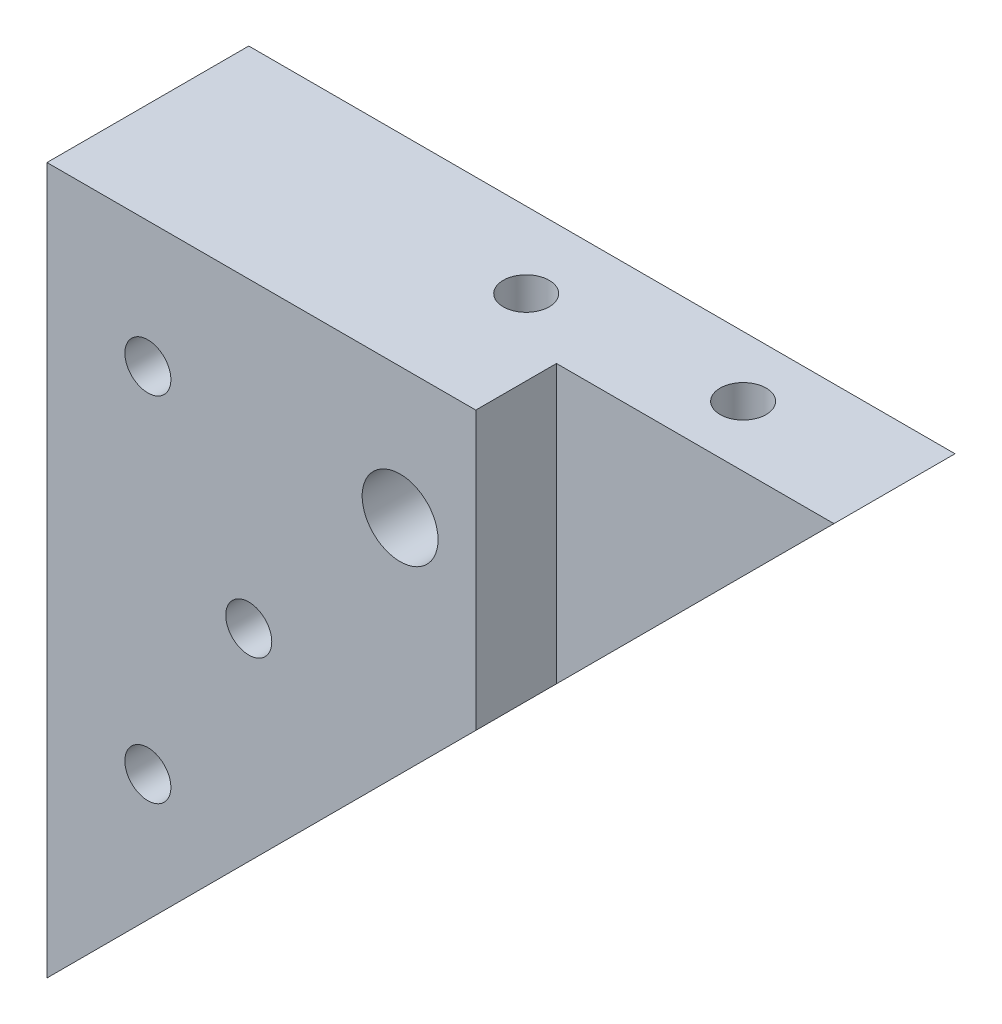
ISO-10303-21;
HEADER;
FILE_DESCRIPTION(('STEP AP214'),'2;1');
FILE_NAME('part.step','',(''),(''),'','','');
FILE_SCHEMA(('AUTOMOTIVE_DESIGN { 1 0 10303 214 1 1 1 1 }'));
ENDSEC;
DATA;
#1=APPLICATION_CONTEXT('core data for automotive mechanical design processes');
#2=APPLICATION_PROTOCOL_DEFINITION('international standard','automotive_design',2000,#1);
#3=PRODUCT_CONTEXT('',#1,'mechanical');
#4=PRODUCT('Part','Part','',(#3));
#5=PRODUCT_RELATED_PRODUCT_CATEGORY('part','',(#4));
#6=PRODUCT_DEFINITION_FORMATION('','',#4);
#7=PRODUCT_DEFINITION_CONTEXT('part definition',#1,'design');
#8=PRODUCT_DEFINITION('design','',#6,#7);
#9=PRODUCT_DEFINITION_SHAPE('','',#8);
#10=(LENGTH_UNIT() NAMED_UNIT(*) SI_UNIT(.MILLI.,.METRE.));
#11=(NAMED_UNIT(*) PLANE_ANGLE_UNIT() SI_UNIT($,.RADIAN.));
#12=(NAMED_UNIT(*) SI_UNIT($,.STERADIAN.) SOLID_ANGLE_UNIT());
#13=UNCERTAINTY_MEASURE_WITH_UNIT(LENGTH_MEASURE(1.E-05),#10,'distance_accuracy_value','');
#14=(GEOMETRIC_REPRESENTATION_CONTEXT(3) GLOBAL_UNCERTAINTY_ASSIGNED_CONTEXT((#13)) GLOBAL_UNIT_ASSIGNED_CONTEXT((#10,
#11,#12)) REPRESENTATION_CONTEXT('',''));
#15=CARTESIAN_POINT('',(0.,0.,0.));
#16=DIRECTION('',(0.,0.,1.));
#17=DIRECTION('',(1.,0.,0.));
#18=AXIS2_PLACEMENT_3D('',#15,#16,#17);
#19=CARTESIAN_POINT('',(88.9,88.9,-25.4));
#20=DIRECTION('',(0.,-1.,0.));
#21=DIRECTION('',(1.,0.,0.));
#22=AXIS2_PLACEMENT_3D('',#19,#20,#21);
#23=PLANE('',#22);
#24=CARTESIAN_POINT('',(44.45,88.9,-15.875));
#25=DIRECTION('',(0.,-1.,0.));
#26=DIRECTION('',(-1.,0.,0.));
#27=AXIS2_PLACEMENT_3D('',#24,#25,#26);
#28=CIRCLE('',#27,2.8956);
#29=CARTESIAN_POINT('',(41.5544,88.9,-15.875));
#30=VERTEX_POINT('',#29);
#31=EDGE_CURVE('E228',#30,#30,#28,.T.);
#32=ORIENTED_EDGE('',*,*,#31,.T.);
#33=EDGE_LOOP('',(#32));
#34=FACE_BOUND('',#33,.T.);
#35=CARTESIAN_POINT('',(69.85,88.9,-17.78));
#36=DIRECTION('',(0.,-1.,0.));
#37=DIRECTION('',(-1.,0.,0.));
#38=AXIS2_PLACEMENT_3D('',#35,#36,#37);
#39=CIRCLE('',#38,2.89559999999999);
#40=CARTESIAN_POINT('',(66.9544,88.9,-17.78));
#41=VERTEX_POINT('',#40);
#42=EDGE_CURVE('E107',#41,#41,#39,.T.);
#43=ORIENTED_EDGE('',*,*,#42,.T.);
#44=EDGE_LOOP('',(#43));
#45=FACE_BOUND('',#44,.T.);
#46=DIRECTION('',(0.,0.,1.));
#47=VECTOR('',#46,1.);
#48=CARTESIAN_POINT('',(88.9,88.9,-25.4));
#49=LINE('',#48,#47);
#50=CARTESIAN_POINT('',(88.9,88.9,-25.4));
#51=VERTEX_POINT('',#50);
#52=CARTESIAN_POINT('',(88.9,88.9,-10.16));
#53=VERTEX_POINT('',#52);
#54=EDGE_CURVE('E147',#51,#53,#49,.T.);
#55=ORIENTED_EDGE('',*,*,#54,.F.);
#56=DIRECTION('',(-1.,0.,0.));
#57=VECTOR('',#56,1.);
#58=CARTESIAN_POINT('',(88.9,88.9,-25.4));
#59=LINE('',#58,#57);
#60=CARTESIAN_POINT('',(0.,88.9,-25.4));
#61=VERTEX_POINT('',#60);
#62=EDGE_CURVE('E139',#51,#61,#59,.T.);
#63=ORIENTED_EDGE('',*,*,#62,.T.);
#64=DIRECTION('',(0.,0.,1.));
#65=VECTOR('',#64,1.);
#66=CARTESIAN_POINT('',(0.,88.9,-25.4));
#67=LINE('',#66,#65);
#68=CARTESIAN_POINT('',(0.,88.9,0.));
#69=VERTEX_POINT('',#68);
#70=EDGE_CURVE('E153',#61,#69,#67,.T.);
#71=ORIENTED_EDGE('',*,*,#70,.T.);
#72=DIRECTION('',(-1.,0.,0.));
#73=VECTOR('',#72,1.);
#74=CARTESIAN_POINT('',(88.9,88.9,0.));
#75=LINE('',#74,#73);
#76=CARTESIAN_POINT('',(53.975,88.9,0.));
#77=VERTEX_POINT('',#76);
#78=EDGE_CURVE('E131',#77,#69,#75,.T.);
#79=ORIENTED_EDGE('',*,*,#78,.F.);
#80=DIRECTION('',(0.,0.,-1.));
#81=VECTOR('',#80,1.);
#82=CARTESIAN_POINT('',(53.975,88.9,-10.16));
#83=LINE('',#82,#81);
#84=CARTESIAN_POINT('',(53.975,88.9,-10.16));
#85=VERTEX_POINT('',#84);
#86=EDGE_CURVE('E121',#77,#85,#83,.T.);
#87=ORIENTED_EDGE('',*,*,#86,.T.);
#88=DIRECTION('',(1.,0.,0.));
#89=VECTOR('',#88,1.);
#90=CARTESIAN_POINT('',(88.9,88.9,-10.16));
#91=LINE('',#90,#89);
#92=EDGE_CURVE('E124',#85,#53,#91,.T.);
#93=ORIENTED_EDGE('',*,*,#92,.T.);
#94=EDGE_LOOP('',(#55,#63,#71,#79,#87,#93));
#95=FACE_BOUND('',#94,.T.);
#96=ADVANCED_FACE('F34',(#34,#45,#95),#23,.F.);
#97=CARTESIAN_POINT('',(0.,88.9,-25.4));
#98=DIRECTION('',(1.,0.,0.));
#99=DIRECTION('',(0.,1.,0.));
#100=AXIS2_PLACEMENT_3D('',#97,#98,#99);
#101=PLANE('',#100);
#102=DIRECTION('',(0.,-1.,0.));
#103=VECTOR('',#102,1.);
#104=CARTESIAN_POINT('',(0.,88.9,0.));
#105=LINE('',#104,#103);
#106=CARTESIAN_POINT('',(0.,0.,0.));
#107=VERTEX_POINT('',#106);
#108=EDGE_CURVE('E134',#69,#107,#105,.T.);
#109=ORIENTED_EDGE('',*,*,#108,.F.);
#110=ORIENTED_EDGE('',*,*,#70,.F.);
#111=DIRECTION('',(0.,-1.,0.));
#112=VECTOR('',#111,1.);
#113=CARTESIAN_POINT('',(0.,88.9,-25.4));
#114=LINE('',#113,#112);
#115=CARTESIAN_POINT('',(0.,0.,-25.4));
#116=VERTEX_POINT('',#115);
#117=EDGE_CURVE('E142',#61,#116,#114,.T.);
#118=ORIENTED_EDGE('',*,*,#117,.T.);
#119=DIRECTION('',(0.,0.,1.));
#120=VECTOR('',#119,1.);
#121=CARTESIAN_POINT('',(0.,0.,-25.4));
#122=LINE('',#121,#120);
#123=EDGE_CURVE('E150',#116,#107,#122,.T.);
#124=ORIENTED_EDGE('',*,*,#123,.T.);
#125=EDGE_LOOP('',(#109,#110,#118,#124));
#126=FACE_BOUND('',#125,.T.);
#127=ADVANCED_FACE('F205',(#126),#101,.F.);
#128=CARTESIAN_POINT('',(0.,0.,-25.4));
#129=DIRECTION('',(-0.707106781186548,0.707106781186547,0.));
#130=DIRECTION('',(-0.707106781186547,-0.707106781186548,0.));
#131=AXIS2_PLACEMENT_3D('',#128,#129,#130);
#132=PLANE('',#131);
#133=DIRECTION('',(0.,0.,1.));
#134=VECTOR('',#133,1.);
#135=CARTESIAN_POINT('',(76.2,76.2,-25.4));
#136=LINE('',#135,#134);
#137=CARTESIAN_POINT('',(76.2,76.2,-19.684322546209));
#138=VERTEX_POINT('',#137);
#139=CARTESIAN_POINT('',(76.2,76.2,-15.875677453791));
#140=VERTEX_POINT('',#139);
#141=EDGE_CURVE('E95',#138,#140,#136,.T.);
#142=ORIENTED_EDGE('',*,*,#141,.F.);
#143=CARTESIAN_POINT('',(69.85,69.85,-17.78));
#144=DIRECTION('',(0.707106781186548,-0.707106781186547,0.));
#145=DIRECTION('',(0.707106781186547,0.707106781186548,0.));
#146=AXIS2_PLACEMENT_3D('',#143,#144,#145);
#147=ELLIPSE('',#146,9.3753873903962,6.6294);
#148=EDGE_CURVE('E99',#140,#138,#147,.T.);
#149=ORIENTED_EDGE('',*,*,#148,.F.);
#150=EDGE_LOOP('',(#142,#149));
#151=FACE_BOUND('',#150,.T.);
#152=DIRECTION('',(0.,0.,-1.));
#153=VECTOR('',#152,1.);
#154=CARTESIAN_POINT('',(53.975,53.975,-25.4));
#155=LINE('',#154,#153);
#156=CARTESIAN_POINT('',(53.975,53.975,0.));
#157=VERTEX_POINT('',#156);
#158=CARTESIAN_POINT('',(53.975,53.975,-10.16));
#159=VERTEX_POINT('',#158);
#160=EDGE_CURVE('E129',#157,#159,#155,.T.);
#161=ORIENTED_EDGE('',*,*,#160,.F.);
#162=DIRECTION('',(0.707106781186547,0.707106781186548,0.));
#163=VECTOR('',#162,1.);
#164=CARTESIAN_POINT('',(0.,0.,0.));
#165=LINE('',#164,#163);
#166=EDGE_CURVE('E137',#107,#157,#165,.T.);
#167=ORIENTED_EDGE('',*,*,#166,.F.);
#168=ORIENTED_EDGE('',*,*,#123,.F.);
#169=DIRECTION('',(0.707106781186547,0.707106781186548,0.));
#170=VECTOR('',#169,1.);
#171=CARTESIAN_POINT('',(0.,0.,-25.4));
#172=LINE('',#171,#170);
#173=EDGE_CURVE('E145',#116,#51,#172,.T.);
#174=ORIENTED_EDGE('',*,*,#173,.T.);
#175=ORIENTED_EDGE('',*,*,#54,.T.);
#176=DIRECTION('',(0.707106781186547,0.707106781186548,0.));
#177=VECTOR('',#176,1.);
#178=CARTESIAN_POINT('',(0.,0.,-10.16));
#179=LINE('',#178,#177);
#180=EDGE_CURVE('E103',#159,#53,#179,.T.);
#181=ORIENTED_EDGE('',*,*,#180,.F.);
#182=EDGE_LOOP('',(#161,#167,#168,#174,#175,#181));
#183=FACE_BOUND('',#182,.T.);
#184=ADVANCED_FACE('F105',(#151,#183),#132,.F.);
#185=CARTESIAN_POINT('',(0.,88.9,-25.4));
#186=DIRECTION('',(0.,0.,-1.));
#187=DIRECTION('',(1.,0.,0.));
#188=AXIS2_PLACEMENT_3D('',#185,#186,#187);
#189=PLANE('',#188);
#190=CARTESIAN_POINT('',(25.4,50.8,-25.4));
#191=DIRECTION('',(0.,0.,1.));
#192=DIRECTION('',(1.,0.,0.));
#193=AXIS2_PLACEMENT_3D('',#190,#191,#192);
#194=CIRCLE('',#193,4.92759999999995);
#195=CARTESIAN_POINT('',(30.3275999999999,50.8,-25.4));
#196=VERTEX_POINT('',#195);
#197=EDGE_CURVE('E166',#196,#196,#194,.F.);
#198=ORIENTED_EDGE('',*,*,#197,.F.);
#199=EDGE_LOOP('',(#198));
#200=FACE_BOUND('',#199,.T.);
#201=CARTESIAN_POINT('',(12.7,28.575,-25.4));
#202=DIRECTION('',(0.,0.,1.));
#203=DIRECTION('',(1.,0.,0.));
#204=AXIS2_PLACEMENT_3D('',#201,#202,#203);
#205=CIRCLE('',#204,4.92759999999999);
#206=CARTESIAN_POINT('',(17.6276,28.575,-25.4));
#207=VERTEX_POINT('',#206);
#208=EDGE_CURVE('E163',#207,#207,#205,.F.);
#209=ORIENTED_EDGE('',*,*,#208,.F.);
#210=EDGE_LOOP('',(#209));
#211=FACE_BOUND('',#210,.T.);
#212=CARTESIAN_POINT('',(12.7,73.025,-25.4));
#213=DIRECTION('',(0.,0.,1.));
#214=DIRECTION('',(1.,0.,0.));
#215=AXIS2_PLACEMENT_3D('',#212,#213,#214);
#216=CIRCLE('',#215,4.92759999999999);
#217=CARTESIAN_POINT('',(17.6276,73.025,-25.4));
#218=VERTEX_POINT('',#217);
#219=EDGE_CURVE('E160',#218,#218,#216,.F.);
#220=ORIENTED_EDGE('',*,*,#219,.F.);
#221=EDGE_LOOP('',(#220));
#222=FACE_BOUND('',#221,.T.);
#223=CARTESIAN_POINT('',(44.45,72.39,-25.4));
#224=DIRECTION('',(0.,0.,1.));
#225=DIRECTION('',(1.,0.,0.));
#226=AXIS2_PLACEMENT_3D('',#223,#224,#225);
#227=CIRCLE('',#226,4.77519999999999);
#228=CARTESIAN_POINT('',(49.2252,72.39,-25.4));
#229=VERTEX_POINT('',#228);
#230=EDGE_CURVE('E110',#229,#229,#227,.T.);
#231=ORIENTED_EDGE('',*,*,#230,.T.);
#232=EDGE_LOOP('',(#231));
#233=FACE_BOUND('',#232,.T.);
#234=ORIENTED_EDGE('',*,*,#62,.F.);
#235=ORIENTED_EDGE('',*,*,#173,.F.);
#236=ORIENTED_EDGE('',*,*,#117,.F.);
#237=EDGE_LOOP('',(#234,#235,#236));
#238=FACE_BOUND('',#237,.T.);
#239=ADVANCED_FACE('F199',(#200,#211,#222,#233,#238),#189,.T.);
#240=CARTESIAN_POINT('',(0.,88.9,0.));
#241=DIRECTION('',(0.,0.,-1.));
#242=DIRECTION('',(1.,0.,0.));
#243=AXIS2_PLACEMENT_3D('',#240,#241,#242);
#244=PLANE('',#243);
#245=CARTESIAN_POINT('',(25.4,50.8,0.));
#246=DIRECTION('',(0.,0.,1.));
#247=DIRECTION('',(1.,0.,0.));
#248=AXIS2_PLACEMENT_3D('',#245,#246,#247);
#249=CIRCLE('',#248,2.8956);
#250=CARTESIAN_POINT('',(28.2956,50.8,0.));
#251=VERTEX_POINT('',#250);
#252=EDGE_CURVE('E279',#251,#251,#249,.T.);
#253=ORIENTED_EDGE('',*,*,#252,.F.);
#254=EDGE_LOOP('',(#253));
#255=FACE_BOUND('',#254,.T.);
#256=CARTESIAN_POINT('',(12.7,28.575,0.));
#257=DIRECTION('',(0.,0.,1.));
#258=DIRECTION('',(1.,0.,0.));
#259=AXIS2_PLACEMENT_3D('',#256,#257,#258);
#260=CIRCLE('',#259,2.8956);
#261=CARTESIAN_POINT('',(15.5956,28.575,0.));
#262=VERTEX_POINT('',#261);
#263=EDGE_CURVE('E277',#262,#262,#260,.T.);
#264=ORIENTED_EDGE('',*,*,#263,.F.);
#265=EDGE_LOOP('',(#264));
#266=FACE_BOUND('',#265,.T.);
#267=CARTESIAN_POINT('',(12.7,73.025,0.));
#268=DIRECTION('',(0.,0.,1.));
#269=DIRECTION('',(1.,0.,0.));
#270=AXIS2_PLACEMENT_3D('',#267,#268,#269);
#271=CIRCLE('',#270,2.8956);
#272=CARTESIAN_POINT('',(15.5956,73.025,0.));
#273=VERTEX_POINT('',#272);
#274=EDGE_CURVE('E97',#273,#273,#271,.T.);
#275=ORIENTED_EDGE('',*,*,#274,.F.);
#276=EDGE_LOOP('',(#275));
#277=FACE_BOUND('',#276,.T.);
#278=CARTESIAN_POINT('',(44.45,72.39,0.));
#279=DIRECTION('',(0.,0.,1.));
#280=DIRECTION('',(1.,0.,0.));
#281=AXIS2_PLACEMENT_3D('',#278,#279,#280);
#282=CIRCLE('',#281,4.77519999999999);
#283=CARTESIAN_POINT('',(49.2252,72.39,0.));
#284=VERTEX_POINT('',#283);
#285=EDGE_CURVE('E118',#284,#284,#282,.T.);
#286=ORIENTED_EDGE('',*,*,#285,.F.);
#287=EDGE_LOOP('',(#286));
#288=FACE_BOUND('',#287,.T.);
#289=ORIENTED_EDGE('',*,*,#78,.T.);
#290=ORIENTED_EDGE('',*,*,#108,.T.);
#291=ORIENTED_EDGE('',*,*,#166,.T.);
#292=DIRECTION('',(0.,-1.,0.));
#293=VECTOR('',#292,1.);
#294=CARTESIAN_POINT('',(53.975,88.9,0.));
#295=LINE('',#294,#293);
#296=EDGE_CURVE('E62',#77,#157,#295,.T.);
#297=ORIENTED_EDGE('',*,*,#296,.F.);
#298=EDGE_LOOP('',(#289,#290,#291,#297));
#299=FACE_BOUND('',#298,.T.);
#300=ADVANCED_FACE('F193',(#255,#266,#277,#288,#299),#244,.F.);
#301=CARTESIAN_POINT('',(88.9,0.,-10.16));
#302=DIRECTION('',(0.,0.,-1.));
#303=DIRECTION('',(1.,0.,0.));
#304=AXIS2_PLACEMENT_3D('',#301,#302,#303);
#305=PLANE('',#304);
#306=DIRECTION('',(0.,1.,0.));
#307=VECTOR('',#306,1.);
#308=CARTESIAN_POINT('',(53.975,0.,-10.16));
#309=LINE('',#308,#307);
#310=EDGE_CURVE('E127',#159,#85,#309,.T.);
#311=ORIENTED_EDGE('',*,*,#310,.F.);
#312=ORIENTED_EDGE('',*,*,#180,.T.);
#313=ORIENTED_EDGE('',*,*,#92,.F.);
#314=EDGE_LOOP('',(#311,#312,#313));
#315=FACE_BOUND('',#314,.T.);
#316=ADVANCED_FACE('F189',(#315),#305,.F.);
#317=CARTESIAN_POINT('',(53.975,0.,-10.16));
#318=DIRECTION('',(-1.,0.,0.));
#319=DIRECTION('',(0.,-1.,0.));
#320=AXIS2_PLACEMENT_3D('',#317,#318,#319);
#321=PLANE('',#320);
#322=ORIENTED_EDGE('',*,*,#296,.T.);
#323=ORIENTED_EDGE('',*,*,#160,.T.);
#324=ORIENTED_EDGE('',*,*,#310,.T.);
#325=ORIENTED_EDGE('',*,*,#86,.F.);
#326=EDGE_LOOP('',(#322,#323,#324,#325));
#327=FACE_BOUND('',#326,.T.);
#328=ADVANCED_FACE('F186',(#327),#321,.F.);
#329=CARTESIAN_POINT('',(44.45,72.39,0.));
#330=DIRECTION('',(0.,0.,-1.));
#331=DIRECTION('',(1.,0.,0.));
#332=AXIS2_PLACEMENT_3D('',#329,#330,#331);
#333=CYLINDRICAL_SURFACE('',#332,4.77519999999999);
#334=CARTESIAN_POINT('',(41.5544,68.5928911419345,-15.875));
#335=CARTESIAN_POINT('',(41.5544007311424,68.5928900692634,-15.802458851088));
#336=CARTESIAN_POINT('',(41.557133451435,68.590801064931,-15.7298907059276));
#337=CARTESIAN_POINT('',(41.5680067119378,68.5825482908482,-15.5853779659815));
#338=CARTESIAN_POINT('',(41.5761510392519,68.5763816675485,-15.5134338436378));
#339=CARTESIAN_POINT('',(41.6085719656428,68.5520837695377,-15.299129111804));
#340=CARTESIAN_POINT('',(41.6408359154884,68.5281557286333,-15.158535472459));
#341=CARTESIAN_POINT('',(41.724391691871,68.4687577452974,-14.8872661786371));
#342=CARTESIAN_POINT('',(41.7755269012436,68.43338309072,-14.7565192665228));
#343=CARTESIAN_POINT('',(41.8949072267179,68.3552602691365,-14.5055823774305));
#344=CARTESIAN_POINT('',(41.9631508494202,68.3125127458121,-14.3853914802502));
#345=CARTESIAN_POINT('',(42.1248021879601,68.2179745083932,-14.1424201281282));
#346=CARTESIAN_POINT('',(42.220292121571,68.1657219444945,-14.0212042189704));
#347=CARTESIAN_POINT('',(42.429430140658,68.0617767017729,-13.7952049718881));
#348=CARTESIAN_POINT('',(42.5430933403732,68.0100845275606,-13.6904354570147));
#349=CARTESIAN_POINT('',(42.8008112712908,67.9062526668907,-13.4887373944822));
#350=CARTESIAN_POINT('',(42.9468394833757,67.8547012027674,-13.3939728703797));
#351=CARTESIAN_POINT('',(43.1788362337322,67.7863896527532,-13.2718655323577));
#352=CARTESIAN_POINT('',(43.2583531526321,67.7651167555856,-13.2344948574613));
#353=CARTESIAN_POINT('',(43.4211982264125,67.7261939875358,-13.1668973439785));
#354=CARTESIAN_POINT('',(43.5045237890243,67.7085416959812,-13.1366657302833));
#355=CARTESIAN_POINT('',(43.6661093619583,67.6789347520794,-13.0863675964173));
#356=CARTESIAN_POINT('',(43.7440818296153,67.6665945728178,-13.0656015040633));
#357=CARTESIAN_POINT('',(43.901935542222,67.6456882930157,-13.0305922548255));
#358=CARTESIAN_POINT('',(43.9818156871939,67.6371200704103,-13.0163454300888));
#359=CARTESIAN_POINT('',(44.1427787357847,67.62400991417,-12.9946003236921));
#360=CARTESIAN_POINT('',(44.2238609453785,67.6194657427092,-12.9870982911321));
#361=CARTESIAN_POINT('',(44.3864672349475,67.6145282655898,-12.9789508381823));
#362=CARTESIAN_POINT('',(44.4679912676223,67.6141345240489,-12.9783046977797));
#363=CARTESIAN_POINT('',(44.6914267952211,67.6188007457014,-12.9859948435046));
#364=CARTESIAN_POINT('',(44.8330887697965,67.6281412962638,-13.0013800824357));
#365=CARTESIAN_POINT('',(45.111281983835,67.6587333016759,-13.0523678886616));
#366=CARTESIAN_POINT('',(45.2478128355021,67.6799856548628,-13.0879719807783));
#367=CARTESIAN_POINT('',(45.5131783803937,67.7326853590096,-13.1779866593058));
#368=CARTESIAN_POINT('',(45.6419709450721,67.7641834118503,-13.2324908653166));
#369=CARTESIAN_POINT('',(45.8887193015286,67.8348793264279,-13.358297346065));
#370=CARTESIAN_POINT('',(46.0066723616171,67.8740791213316,-13.4296038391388));
#371=CARTESIAN_POINT('',(46.2436771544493,67.9624593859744,-13.5966868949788));
#372=CARTESIAN_POINT('',(46.3611409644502,68.0122734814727,-13.6943787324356));
#373=CARTESIAN_POINT('',(46.5790194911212,68.1139849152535,-13.9065128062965));
#374=CARTESIAN_POINT('',(46.6794102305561,68.165885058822,-14.0209781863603));
#375=CARTESIAN_POINT('',(46.8724473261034,68.2732210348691,-14.2795938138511));
#376=CARTESIAN_POINT('',(46.9627310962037,68.3283372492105,-14.4256570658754));
#377=CARTESIAN_POINT('',(47.1170140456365,68.4279242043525,-14.7343162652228));
#378=CARTESIAN_POINT('',(47.1810618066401,68.472414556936,-14.8968809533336));
#379=CARTESIAN_POINT('',(47.2669899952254,68.5339450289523,-15.1920731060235));
#380=CARTESIAN_POINT('',(47.2954262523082,68.5550757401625,-15.3219372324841));
#381=CARTESIAN_POINT('',(47.3341875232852,68.584134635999,-15.5857305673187));
#382=CARTESIAN_POINT('',(47.3445345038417,68.5920788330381,-15.7196546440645));
#383=CARTESIAN_POINT('',(47.3465102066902,68.593585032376,-15.9879347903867));
#384=CARTESIAN_POINT('',(47.3381090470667,68.5871240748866,-16.1222912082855));
#385=CARTESIAN_POINT('',(47.3030620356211,68.5607664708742,-16.387282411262));
#386=CARTESIAN_POINT('',(47.2764015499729,68.5408590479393,-16.5179141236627));
#387=CARTESIAN_POINT('',(47.2064016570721,68.4904346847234,-16.7716656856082));
#388=CARTESIAN_POINT('',(47.1631436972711,68.4599696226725,-16.894818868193));
#389=CARTESIAN_POINT('',(47.0615020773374,68.3917085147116,-17.1324920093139));
#390=CARTESIAN_POINT('',(47.0031128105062,68.3539097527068,-17.2470087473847));
#391=CARTESIAN_POINT('',(46.8605392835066,68.2668937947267,-17.486395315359));
#392=CARTESIAN_POINT('',(46.7735895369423,68.2168530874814,-17.6093218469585));
#393=CARTESIAN_POINT('',(46.5819782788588,68.1157771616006,-17.8401258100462));
#394=CARTESIAN_POINT('',(46.4772993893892,68.0647410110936,-17.9479882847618));
#395=CARTESIAN_POINT('',(46.2359184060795,67.9591310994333,-18.1606555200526));
#396=CARTESIAN_POINT('',(46.0967924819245,67.9050349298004,-18.263003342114));
#397=CARTESIAN_POINT('',(45.8743422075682,67.8314990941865,-18.3975552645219));
#398=CARTESIAN_POINT('',(45.797864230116,67.8082472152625,-18.4392575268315));
#399=CARTESIAN_POINT('',(45.6407427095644,67.7649284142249,-18.515881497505));
#400=CARTESIAN_POINT('',(45.5601018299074,67.7448594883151,-18.550807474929));
#401=CARTESIAN_POINT('',(45.4009442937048,67.7097846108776,-18.6112275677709));
#402=CARTESIAN_POINT('',(45.32266797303,67.6945241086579,-18.637207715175));
#403=CARTESIAN_POINT('',(45.1636269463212,67.667736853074,-18.6825019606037));
#404=CARTESIAN_POINT('',(45.0828636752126,67.6562079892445,-18.7018198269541));
#405=CARTESIAN_POINT('',(44.919561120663,67.6372331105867,-18.7334820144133));
#406=CARTESIAN_POINT('',(44.8370231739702,67.6297841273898,-18.7458314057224));
#407=CARTESIAN_POINT('',(44.6709469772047,67.6191869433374,-18.7633672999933));
#408=CARTESIAN_POINT('',(44.587408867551,67.6160381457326,-18.7685547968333));
#409=CARTESIAN_POINT('',(44.359490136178,67.6134891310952,-18.7727674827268));
#410=CARTESIAN_POINT('',(44.2148397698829,67.6184522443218,-18.764613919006));
#411=CARTESIAN_POINT('',(43.9294541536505,67.6410935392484,-18.7270675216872));
#412=CARTESIAN_POINT('',(43.7887188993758,67.6587717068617,-18.6976747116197));
#413=CARTESIAN_POINT('',(43.5176656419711,67.7047248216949,-18.619945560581));
#414=CARTESIAN_POINT('',(43.3871932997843,67.7327752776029,-18.572009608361));
#415=CARTESIAN_POINT('',(43.136161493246,67.797268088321,-18.4590466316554));
#416=CARTESIAN_POINT('',(43.0156040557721,67.8337121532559,-18.3940161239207));
#417=CARTESIAN_POINT('',(42.7738013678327,67.9166416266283,-18.2409008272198));
#418=CARTESIAN_POINT('',(42.6538792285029,67.9637856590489,-18.151087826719));
#419=CARTESIAN_POINT('',(42.4298840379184,68.0614169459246,-17.9548661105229));
#420=CARTESIAN_POINT('',(42.3258296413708,68.1119080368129,-17.8484381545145));
#421=CARTESIAN_POINT('',(42.1224353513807,68.2186901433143,-17.6056730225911));
#422=CARTESIAN_POINT('',(42.0255193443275,68.2748696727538,-17.4672428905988));
#423=CARTESIAN_POINT('',(41.8562598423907,68.3793934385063,-17.1733379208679));
#424=CARTESIAN_POINT('',(41.7838972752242,68.4277437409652,-17.0178764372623));
#425=CARTESIAN_POINT('',(41.6800519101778,68.4998849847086,-16.7293278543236));
#426=CARTESIAN_POINT('',(41.643049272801,68.5267490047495,-16.5989940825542));
#427=CARTESIAN_POINT('',(41.5875946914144,68.5676448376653,-16.332699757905));
#428=CARTESIAN_POINT('',(41.5690810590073,68.5817193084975,-16.1967595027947));
#429=CARTESIAN_POINT('',(41.5583462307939,68.5898854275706,-16.0292685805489));
#430=CARTESIAN_POINT('',(41.5568678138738,68.5910105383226,-15.9984503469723));
#431=CARTESIAN_POINT('',(41.554894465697,68.5925136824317,-15.9367563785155));
#432=CARTESIAN_POINT('',(41.554399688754,68.5928915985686,-15.9058806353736));
#433=CARTESIAN_POINT('',(41.5544,68.5928911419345,-15.875));
#434=B_SPLINE_CURVE_WITH_KNOTS('',3,(#334,#335,#336,#337,#338,#339,#340,#341,#342,#343,#344,
#345,#346,#347,#348,#349,#350,#351,#352,#353,#354,#355,#356,#357,#358,#359,#360,#361,#362,#363,
#364,#365,#366,#367,#368,#369,#370,#371,#372,#373,#374,#375,#376,#377,#378,#379,#380,#381,#382,
#383,#384,#385,#386,#387,#388,#389,#390,#391,#392,#393,#394,#395,#396,#397,#398,#399,#400,#401,
#402,#403,#404,#405,#406,#407,#408,#409,#410,#411,#412,#413,#414,#415,#416,#417,#418,#419,#420,
#421,#422,#423,#424,#425,#426,#427,#428,#429,#430,#431,#432,#433),.UNSPECIFIED.,.T.,.F.,(4,2,2,
2,2,2,2,2,2,2,2,2,2,2,2,2,2,2,2,2,2,2,2,2,2,2,2,2,2,2,2,2,2,2,2,2,2,2,2,2,2,2,2,2,2,2,2,2,2,4),
(0.,0.217582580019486,0.435317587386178,0.871494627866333,1.30413027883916,1.73672817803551,
2.22356215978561,2.71080315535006,3.25217192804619,3.52301758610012,3.79368156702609,
4.03821615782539,4.28261299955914,4.5268738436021,4.77110903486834,5.19726066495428,
5.62344443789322,6.05177015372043,6.48020351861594,6.96038218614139,7.44122974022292,
7.97959199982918,8.51695280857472,8.91906410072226,9.32068675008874,9.72294998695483,
10.1255359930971,10.5261711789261,10.9269550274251,11.4011186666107,11.8757497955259,
12.4156024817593,12.6857513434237,12.9557294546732,13.2069901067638,13.4581084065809,
13.7090437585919,13.9599442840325,14.3924615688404,14.8249783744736,15.2486351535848,
15.6723783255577,16.1417386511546,16.6116465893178,17.1434146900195,17.6747687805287,
18.0874967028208,18.4988429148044,18.5914528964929,18.6840774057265),.UNSPECIFIED.);
#435=CARTESIAN_POINT('',(41.5544,68.5928911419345,-15.875));
#436=VERTEX_POINT('',#435);
#437=EDGE_CURVE('E37',#436,#436,#434,.T.);
#438=ORIENTED_EDGE('',*,*,#437,.F.);
#439=EDGE_LOOP('',(#438));
#440=FACE_BOUND('',#439,.T.);
#441=CARTESIAN_POINT('',(41.5544,76.1871088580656,-15.875));
#442=CARTESIAN_POINT('',(41.5544007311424,76.1871099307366,-15.947541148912));
#443=CARTESIAN_POINT('',(41.557133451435,76.189198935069,-16.0201092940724));
#444=CARTESIAN_POINT('',(41.5680067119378,76.1974517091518,-16.1646220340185));
#445=CARTESIAN_POINT('',(41.5761510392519,76.2036183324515,-16.2365661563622));
#446=CARTESIAN_POINT('',(41.6085719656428,76.2279162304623,-16.450870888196));
#447=CARTESIAN_POINT('',(41.6408359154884,76.2518442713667,-16.591464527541));
#448=CARTESIAN_POINT('',(41.724391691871,76.3112422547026,-16.8627338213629));
#449=CARTESIAN_POINT('',(41.7755269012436,76.34661690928,-16.9934807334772));
#450=CARTESIAN_POINT('',(41.8949072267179,76.4247397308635,-17.2444176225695));
#451=CARTESIAN_POINT('',(41.9631508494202,76.4674872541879,-17.3646085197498));
#452=CARTESIAN_POINT('',(42.1248021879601,76.5620254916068,-17.6075798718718));
#453=CARTESIAN_POINT('',(42.220292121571,76.6142780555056,-17.7287957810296));
#454=CARTESIAN_POINT('',(42.429430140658,76.7182232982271,-17.9547950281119));
#455=CARTESIAN_POINT('',(42.5430933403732,76.7699154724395,-18.0595645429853));
#456=CARTESIAN_POINT('',(42.8008112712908,76.8737473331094,-18.2612626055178));
#457=CARTESIAN_POINT('',(42.9468394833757,76.9252987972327,-18.3560271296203));
#458=CARTESIAN_POINT('',(43.1788362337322,76.9936103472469,-18.4781344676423));
#459=CARTESIAN_POINT('',(43.2583531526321,77.0148832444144,-18.5155051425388));
#460=CARTESIAN_POINT('',(43.4211982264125,77.0538060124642,-18.5831026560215));
#461=CARTESIAN_POINT('',(43.5045237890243,77.0714583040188,-18.6133342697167));
#462=CARTESIAN_POINT('',(43.6661093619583,77.1010652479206,-18.6636324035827));
#463=CARTESIAN_POINT('',(43.7440818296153,77.1134054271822,-18.6843984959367));
#464=CARTESIAN_POINT('',(43.901935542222,77.1343117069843,-18.7194077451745));
#465=CARTESIAN_POINT('',(43.9818156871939,77.1428799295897,-18.7336545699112));
#466=CARTESIAN_POINT('',(44.1427787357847,77.15599008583,-18.7553996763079));
#467=CARTESIAN_POINT('',(44.2238609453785,77.1605342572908,-18.7629017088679));
#468=CARTESIAN_POINT('',(44.3864672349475,77.1654717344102,-18.7710491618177));
#469=CARTESIAN_POINT('',(44.4679912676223,77.1658654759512,-18.7716953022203));
#470=CARTESIAN_POINT('',(44.6914267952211,77.1611992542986,-18.7640051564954));
#471=CARTESIAN_POINT('',(44.8330887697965,77.1518587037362,-18.7486199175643));
#472=CARTESIAN_POINT('',(45.111281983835,77.1212666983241,-18.6976321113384));
#473=CARTESIAN_POINT('',(45.2478128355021,77.1000143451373,-18.6620280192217));
#474=CARTESIAN_POINT('',(45.5131783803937,77.0473146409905,-18.5720133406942));
#475=CARTESIAN_POINT('',(45.6419709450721,77.0158165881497,-18.5175091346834));
#476=CARTESIAN_POINT('',(45.8887193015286,76.9451206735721,-18.391702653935));
#477=CARTESIAN_POINT('',(46.0066723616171,76.9059208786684,-18.3203961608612));
#478=CARTESIAN_POINT('',(46.2436771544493,76.8175406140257,-18.1533131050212));
#479=CARTESIAN_POINT('',(46.3611409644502,76.7677265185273,-18.0556212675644));
#480=CARTESIAN_POINT('',(46.5790194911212,76.6660150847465,-17.8434871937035));
#481=CARTESIAN_POINT('',(46.6794102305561,76.6141149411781,-17.7290218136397));
#482=CARTESIAN_POINT('',(46.8724473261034,76.5067789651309,-17.4704061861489));
#483=CARTESIAN_POINT('',(46.9627310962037,76.4516627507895,-17.3243429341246));
#484=CARTESIAN_POINT('',(47.1170140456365,76.3520757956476,-17.0156837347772));
#485=CARTESIAN_POINT('',(47.1810618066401,76.307585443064,-16.8531190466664));
#486=CARTESIAN_POINT('',(47.2669899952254,76.2460549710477,-16.5579268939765));
#487=CARTESIAN_POINT('',(47.2954262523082,76.2249242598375,-16.4280627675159));
#488=CARTESIAN_POINT('',(47.3341875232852,76.195865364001,-16.1642694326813));
#489=CARTESIAN_POINT('',(47.3445345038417,76.187921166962,-16.0303453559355));
#490=CARTESIAN_POINT('',(47.3465102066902,76.186414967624,-15.7620652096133));
#491=CARTESIAN_POINT('',(47.3381090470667,76.1928759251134,-15.6277087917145));
#492=CARTESIAN_POINT('',(47.3030620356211,76.2192335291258,-15.362717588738));
#493=CARTESIAN_POINT('',(47.2764015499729,76.2391409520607,-15.2320858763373));
#494=CARTESIAN_POINT('',(47.2064016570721,76.2895653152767,-14.9783343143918));
#495=CARTESIAN_POINT('',(47.1631436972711,76.3200303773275,-14.855181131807));
#496=CARTESIAN_POINT('',(47.0615020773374,76.3882914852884,-14.6175079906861));
#497=CARTESIAN_POINT('',(47.0031128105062,76.4260902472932,-14.5029912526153));
#498=CARTESIAN_POINT('',(46.8605392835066,76.5131062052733,-14.263604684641));
#499=CARTESIAN_POINT('',(46.7735895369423,76.5631469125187,-14.1406781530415));
#500=CARTESIAN_POINT('',(46.5819782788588,76.6642228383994,-13.9098741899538));
#501=CARTESIAN_POINT('',(46.4772993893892,76.7152589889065,-13.8020117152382));
#502=CARTESIAN_POINT('',(46.2359184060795,76.8208689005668,-13.5893444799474));
#503=CARTESIAN_POINT('',(46.0967924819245,76.8749650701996,-13.486996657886));
#504=CARTESIAN_POINT('',(45.8743422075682,76.9485009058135,-13.3524447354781));
#505=CARTESIAN_POINT('',(45.7978642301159,76.9717527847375,-13.3107424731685));
#506=CARTESIAN_POINT('',(45.6407427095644,77.0150715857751,-13.234118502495));
#507=CARTESIAN_POINT('',(45.5601018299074,77.0351405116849,-13.199192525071));
#508=CARTESIAN_POINT('',(45.4009442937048,77.0702153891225,-13.1387724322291));
#509=CARTESIAN_POINT('',(45.32266797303,77.0854758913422,-13.112792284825));
#510=CARTESIAN_POINT('',(45.1636269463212,77.112263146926,-13.0674980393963));
#511=CARTESIAN_POINT('',(45.0828636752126,77.1237920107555,-13.0481801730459));
#512=CARTESIAN_POINT('',(44.919561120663,77.1427668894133,-13.0165179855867));
#513=CARTESIAN_POINT('',(44.8370231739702,77.1502158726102,-13.0041685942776));
#514=CARTESIAN_POINT('',(44.6709469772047,77.1608130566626,-12.9866327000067));
#515=CARTESIAN_POINT('',(44.5874088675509,77.1639618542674,-12.9814452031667));
#516=CARTESIAN_POINT('',(44.359490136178,77.1665108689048,-12.9772325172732));
#517=CARTESIAN_POINT('',(44.2148397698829,77.1615477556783,-12.985386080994));
#518=CARTESIAN_POINT('',(43.9294541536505,77.1389064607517,-13.0229324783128));
#519=CARTESIAN_POINT('',(43.7887188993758,77.1212282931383,-13.0523252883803));
#520=CARTESIAN_POINT('',(43.517665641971,77.0752751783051,-13.130054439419));
#521=CARTESIAN_POINT('',(43.3871932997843,77.0472247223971,-13.177990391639));
#522=CARTESIAN_POINT('',(43.136161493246,76.9827319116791,-13.2909533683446));
#523=CARTESIAN_POINT('',(43.015604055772,76.9462878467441,-13.3559838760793));
#524=CARTESIAN_POINT('',(42.7738013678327,76.8633583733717,-13.5090991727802));
#525=CARTESIAN_POINT('',(42.6538792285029,76.8162143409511,-13.598912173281));
#526=CARTESIAN_POINT('',(42.4298840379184,76.7185830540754,-13.7951338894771));
#527=CARTESIAN_POINT('',(42.3258296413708,76.6680919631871,-13.9015618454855));
#528=CARTESIAN_POINT('',(42.1224353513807,76.5613098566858,-14.1443269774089));
#529=CARTESIAN_POINT('',(42.0255193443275,76.5051303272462,-14.2827571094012));
#530=CARTESIAN_POINT('',(41.8562598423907,76.4006065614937,-14.5766620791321));
#531=CARTESIAN_POINT('',(41.7838972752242,76.3522562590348,-14.7321235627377));
#532=CARTESIAN_POINT('',(41.6800519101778,76.2801150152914,-15.0206721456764));
#533=CARTESIAN_POINT('',(41.643049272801,76.2532509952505,-15.1510059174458));
#534=CARTESIAN_POINT('',(41.5875946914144,76.2123551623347,-15.417300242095));
#535=CARTESIAN_POINT('',(41.5690810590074,76.1982806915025,-15.5532404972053));
#536=CARTESIAN_POINT('',(41.5583462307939,76.1901145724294,-15.7207314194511));
#537=CARTESIAN_POINT('',(41.5568678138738,76.1889894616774,-15.7515496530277));
#538=CARTESIAN_POINT('',(41.5548944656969,76.1874863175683,-15.8132436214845));
#539=CARTESIAN_POINT('',(41.554399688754,76.1871084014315,-15.8441193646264));
#540=CARTESIAN_POINT('',(41.5544,76.1871088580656,-15.875));
#541=B_SPLINE_CURVE_WITH_KNOTS('',3,(#441,#442,#443,#444,#445,#446,#447,#448,#449,#450,#451,
#452,#453,#454,#455,#456,#457,#458,#459,#460,#461,#462,#463,#464,#465,#466,#467,#468,#469,#470,
#471,#472,#473,#474,#475,#476,#477,#478,#479,#480,#481,#482,#483,#484,#485,#486,#487,#488,#489,
#490,#491,#492,#493,#494,#495,#496,#497,#498,#499,#500,#501,#502,#503,#504,#505,#506,#507,#508,
#509,#510,#511,#512,#513,#514,#515,#516,#517,#518,#519,#520,#521,#522,#523,#524,#525,#526,#527,
#528,#529,#530,#531,#532,#533,#534,#535,#536,#537,#538,#539,#540),.UNSPECIFIED.,.T.,.F.,(4,2,2,
2,2,2,2,2,2,2,2,2,2,2,2,2,2,2,2,2,2,2,2,2,2,2,2,2,2,2,2,2,2,2,2,2,2,2,2,2,2,2,2,2,2,2,2,2,2,4),
(0.,0.217582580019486,0.435317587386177,0.871494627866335,1.30413027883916,1.73672817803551,
2.22356215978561,2.71080315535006,3.25217192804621,3.52301758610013,3.79368156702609,
4.03821615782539,4.28261299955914,4.5268738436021,4.77110903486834,5.19726066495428,
5.62344443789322,6.05177015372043,6.48020351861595,6.96038218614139,7.44122974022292,
7.97959199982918,8.51695280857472,8.91906410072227,9.32068675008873,9.72294998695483,
10.1255359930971,10.5261711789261,10.9269550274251,11.4011186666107,11.8757497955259,
12.4156024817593,12.6857513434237,12.9557294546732,13.2069901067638,13.4581084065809,
13.7090437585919,13.9599442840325,14.3924615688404,14.8249783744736,15.2486351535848,
15.6723783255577,16.1417386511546,16.6116465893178,17.1434146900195,17.6747687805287,
18.0874967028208,18.4988429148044,18.5914528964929,18.6840774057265),.UNSPECIFIED.);
#542=CARTESIAN_POINT('',(41.5544,76.1871088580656,-15.875));
#543=VERTEX_POINT('',#542);
#544=EDGE_CURVE('E170',#543,#543,#541,.T.);
#545=ORIENTED_EDGE('',*,*,#544,.F.);
#546=EDGE_LOOP('',(#545));
#547=FACE_BOUND('',#546,.T.);
#548=ORIENTED_EDGE('',*,*,#285,.T.);
#549=EDGE_LOOP('',(#548));
#550=FACE_BOUND('',#549,.T.);
#551=ORIENTED_EDGE('',*,*,#230,.F.);
#552=EDGE_LOOP('',(#551));
#553=FACE_BOUND('',#552,.T.);
#554=ADVANCED_FACE('F180',(#440,#547,#550,#553),#333,.F.);
#555=CARTESIAN_POINT('',(69.85,0.,-17.78));
#556=DIRECTION('',(0.,1.,0.));
#557=DIRECTION('',(-1.,0.,0.));
#558=AXIS2_PLACEMENT_3D('',#555,#556,#557);
#559=CYLINDRICAL_SURFACE('',#558,2.89559999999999);
#560=CARTESIAN_POINT('',(69.85,76.2,-17.78));
#561=DIRECTION('',(0.,-1.,0.));
#562=DIRECTION('',(-1.,0.,0.));
#563=AXIS2_PLACEMENT_3D('',#560,#561,#562);
#564=CIRCLE('',#563,2.89559999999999);
#565=CARTESIAN_POINT('',(66.9544,76.2,-17.78));
#566=VERTEX_POINT('',#565);
#567=EDGE_CURVE('E96',#566,#566,#564,.F.);
#568=ORIENTED_EDGE('',*,*,#567,.F.);
#569=EDGE_LOOP('',(#568));
#570=FACE_BOUND('',#569,.T.);
#571=ORIENTED_EDGE('',*,*,#42,.F.);
#572=EDGE_LOOP('',(#571));
#573=FACE_BOUND('',#572,.T.);
#574=ADVANCED_FACE('F185',(#570,#573),#559,.F.);
#575=CARTESIAN_POINT('',(69.85,57.15,-17.78));
#576=DIRECTION('',(0.,1.,0.));
#577=DIRECTION('',(-1.,0.,0.));
#578=AXIS2_PLACEMENT_3D('',#575,#576,#577);
#579=CYLINDRICAL_SURFACE('',#578,6.6294);
#580=CARTESIAN_POINT('',(69.85,76.2,-17.78));
#581=DIRECTION('',(0.,-1.,0.));
#582=DIRECTION('',(-1.,0.,0.));
#583=AXIS2_PLACEMENT_3D('',#580,#581,#582);
#584=CIRCLE('',#583,6.6294);
#585=EDGE_CURVE('E54',#140,#138,#584,.T.);
#586=ORIENTED_EDGE('',*,*,#585,.F.);
#587=ORIENTED_EDGE('',*,*,#148,.T.);
#588=EDGE_LOOP('',(#586,#587));
#589=FACE_BOUND('',#588,.T.);
#590=ADVANCED_FACE('F100',(#589),#579,.F.);
#591=CARTESIAN_POINT('',(69.85,76.2,-17.78));
#592=DIRECTION('',(0.,1.,0.));
#593=DIRECTION('',(-1.,0.,0.));
#594=AXIS2_PLACEMENT_3D('',#591,#592,#593);
#595=PLANE('',#594);
#596=ORIENTED_EDGE('',*,*,#567,.T.);
#597=EDGE_LOOP('',(#596));
#598=FACE_BOUND('',#597,.T.);
#599=ORIENTED_EDGE('',*,*,#585,.T.);
#600=ORIENTED_EDGE('',*,*,#141,.T.);
#601=EDGE_LOOP('',(#599,#600));
#602=FACE_BOUND('',#601,.T.);
#603=ADVANCED_FACE('F93',(#598,#602),#595,.F.);
#604=CARTESIAN_POINT('',(12.7,73.025,0.));
#605=DIRECTION('',(0.,0.,-1.));
#606=DIRECTION('',(1.,0.,0.));
#607=AXIS2_PLACEMENT_3D('',#604,#605,#606);
#608=CYLINDRICAL_SURFACE('',#607,2.8956);
#609=CARTESIAN_POINT('',(12.7,73.025,-23.6336093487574));
#610=DIRECTION('',(0.,0.,1.));
#611=DIRECTION('',(1.,0.,0.));
#612=AXIS2_PLACEMENT_3D('',#609,#610,#611);
#613=CIRCLE('',#612,2.8956);
#614=CARTESIAN_POINT('',(15.5956,73.025,-23.6336093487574));
#615=VERTEX_POINT('',#614);
#616=EDGE_CURVE('E11',#615,#615,#613,.T.);
#617=ORIENTED_EDGE('',*,*,#616,.F.);
#618=EDGE_LOOP('',(#617));
#619=FACE_BOUND('',#618,.T.);
#620=ORIENTED_EDGE('',*,*,#274,.T.);
#621=EDGE_LOOP('',(#620));
#622=FACE_BOUND('',#621,.T.);
#623=ADVANCED_FACE('F239',(#619,#622),#608,.F.);
#624=CARTESIAN_POINT('',(12.7,28.575,0.));
#625=DIRECTION('',(0.,0.,-1.));
#626=DIRECTION('',(1.,0.,0.));
#627=AXIS2_PLACEMENT_3D('',#624,#625,#626);
#628=CYLINDRICAL_SURFACE('',#627,2.8956);
#629=CARTESIAN_POINT('',(12.7,28.575,-23.6336093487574));
#630=DIRECTION('',(0.,0.,1.));
#631=DIRECTION('',(1.,0.,0.));
#632=AXIS2_PLACEMENT_3D('',#629,#630,#631);
#633=CIRCLE('',#632,2.8956);
#634=CARTESIAN_POINT('',(15.5956,28.575,-23.6336093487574));
#635=VERTEX_POINT('',#634);
#636=EDGE_CURVE('E47',#635,#635,#633,.T.);
#637=ORIENTED_EDGE('',*,*,#636,.F.);
#638=EDGE_LOOP('',(#637));
#639=FACE_BOUND('',#638,.T.);
#640=ORIENTED_EDGE('',*,*,#263,.T.);
#641=EDGE_LOOP('',(#640));
#642=FACE_BOUND('',#641,.T.);
#643=ADVANCED_FACE('F244',(#639,#642),#628,.F.);
#644=CARTESIAN_POINT('',(25.4,50.8,0.));
#645=DIRECTION('',(0.,0.,-1.));
#646=DIRECTION('',(1.,0.,0.));
#647=AXIS2_PLACEMENT_3D('',#644,#645,#646);
#648=CYLINDRICAL_SURFACE('',#647,2.8956);
#649=CARTESIAN_POINT('',(25.4,50.8,-23.6336093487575));
#650=DIRECTION('',(0.,0.,1.));
#651=DIRECTION('',(1.,0.,0.));
#652=AXIS2_PLACEMENT_3D('',#649,#650,#651);
#653=CIRCLE('',#652,2.8956);
#654=CARTESIAN_POINT('',(28.2956,50.8,-23.6336093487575));
#655=VERTEX_POINT('',#654);
#656=EDGE_CURVE('E102',#655,#655,#653,.T.);
#657=ORIENTED_EDGE('',*,*,#656,.F.);
#658=EDGE_LOOP('',(#657));
#659=FACE_BOUND('',#658,.T.);
#660=ORIENTED_EDGE('',*,*,#252,.T.);
#661=EDGE_LOOP('',(#660));
#662=FACE_BOUND('',#661,.T.);
#663=ADVANCED_FACE('F250',(#659,#662),#648,.F.);
#664=CARTESIAN_POINT('',(25.4,50.8,-23.6336093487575));
#665=DIRECTION('',(0.,0.,-1.));
#666=DIRECTION('',(1.,0.,0.));
#667=AXIS2_PLACEMENT_3D('',#664,#665,#666);
#668=CONICAL_SURFACE('',#667,2.8956,0.855211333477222);
#669=ORIENTED_EDGE('',*,*,#197,.T.);
#670=EDGE_LOOP('',(#669));
#671=FACE_BOUND('',#670,.T.);
#672=ORIENTED_EDGE('',*,*,#656,.T.);
#673=EDGE_LOOP('',(#672));
#674=FACE_BOUND('',#673,.T.);
#675=ADVANCED_FACE('F254',(#671,#674),#668,.F.);
#676=CARTESIAN_POINT('',(12.7,28.575,-23.6336093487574));
#677=DIRECTION('',(0.,0.,-1.));
#678=DIRECTION('',(1.,0.,0.));
#679=AXIS2_PLACEMENT_3D('',#676,#677,#678);
#680=CONICAL_SURFACE('',#679,2.8956,0.85521133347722);
#681=ORIENTED_EDGE('',*,*,#208,.T.);
#682=EDGE_LOOP('',(#681));
#683=FACE_BOUND('',#682,.T.);
#684=ORIENTED_EDGE('',*,*,#636,.T.);
#685=EDGE_LOOP('',(#684));
#686=FACE_BOUND('',#685,.T.);
#687=ADVANCED_FACE('F258',(#683,#686),#680,.F.);
#688=CARTESIAN_POINT('',(12.7,73.025,-23.6336093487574));
#689=DIRECTION('',(0.,0.,-1.));
#690=DIRECTION('',(1.,0.,0.));
#691=AXIS2_PLACEMENT_3D('',#688,#689,#690);
#692=CONICAL_SURFACE('',#691,2.8956,0.85521133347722);
#693=ORIENTED_EDGE('',*,*,#219,.T.);
#694=EDGE_LOOP('',(#693));
#695=FACE_BOUND('',#694,.T.);
#696=ORIENTED_EDGE('',*,*,#616,.T.);
#697=EDGE_LOOP('',(#696));
#698=FACE_BOUND('',#697,.T.);
#699=ADVANCED_FACE('F261',(#695,#698),#692,.F.);
#700=CARTESIAN_POINT('',(44.45,63.5,-15.875));
#701=DIRECTION('',(0.,1.,0.));
#702=DIRECTION('',(-1.,0.,0.));
#703=AXIS2_PLACEMENT_3D('',#700,#701,#702);
#704=CYLINDRICAL_SURFACE('',#703,2.8956);
#705=ORIENTED_EDGE('',*,*,#31,.F.);
#706=EDGE_LOOP('',(#705));
#707=FACE_BOUND('',#706,.T.);
#708=ORIENTED_EDGE('',*,*,#544,.T.);
#709=EDGE_LOOP('',(#708));
#710=FACE_BOUND('',#709,.T.);
#711=ADVANCED_FACE('F264',(#707,#710),#704,.F.);
#712=CARTESIAN_POINT('',(44.45,63.5,-15.875));
#713=DIRECTION('',(0.,-1.,0.));
#714=DIRECTION('',(-1.,0.,0.));
#715=AXIS2_PLACEMENT_3D('',#712,#713,#714);
#716=CIRCLE('',#715,2.8956);
#717=CARTESIAN_POINT('',(41.5544,63.5,-15.875));
#718=VERTEX_POINT('',#717);
#719=EDGE_CURVE('E175',#718,#718,#716,.T.);
#720=ORIENTED_EDGE('',*,*,#719,.T.);
#721=EDGE_LOOP('',(#720));
#722=FACE_BOUND('',#721,.T.);
#723=ORIENTED_EDGE('',*,*,#437,.T.);
#724=EDGE_LOOP('',(#723));
#725=FACE_BOUND('',#724,.T.);
#726=ADVANCED_FACE('F176',(#722,#725),#704,.F.);
#727=CARTESIAN_POINT('',(44.45,63.5,-15.875));
#728=DIRECTION('',(0.,1.,0.));
#729=DIRECTION('',(-1.,0.,0.));
#730=AXIS2_PLACEMENT_3D('',#727,#728,#729);
#731=PLANE('',#730);
#732=ORIENTED_EDGE('',*,*,#719,.F.);
#733=EDGE_LOOP('',(#732));
#734=FACE_BOUND('',#733,.T.);
#735=ADVANCED_FACE('F290',(#734),#731,.T.);
#736=CLOSED_SHELL('',(#96,#127,#184,#239,#300,#316,#328,#554,#574,#590,#603,#623,#643,#663,#675,
#687,#699,#711,#726,#735));
#737=MANIFOLD_SOLID_BREP('B2',#736);
#738=ADVANCED_BREP_SHAPE_REPRESENTATION('',(#18,#737),#14);
#739=SHAPE_DEFINITION_REPRESENTATION(#9,#738);
ENDSEC;
END-ISO-10303-21;
